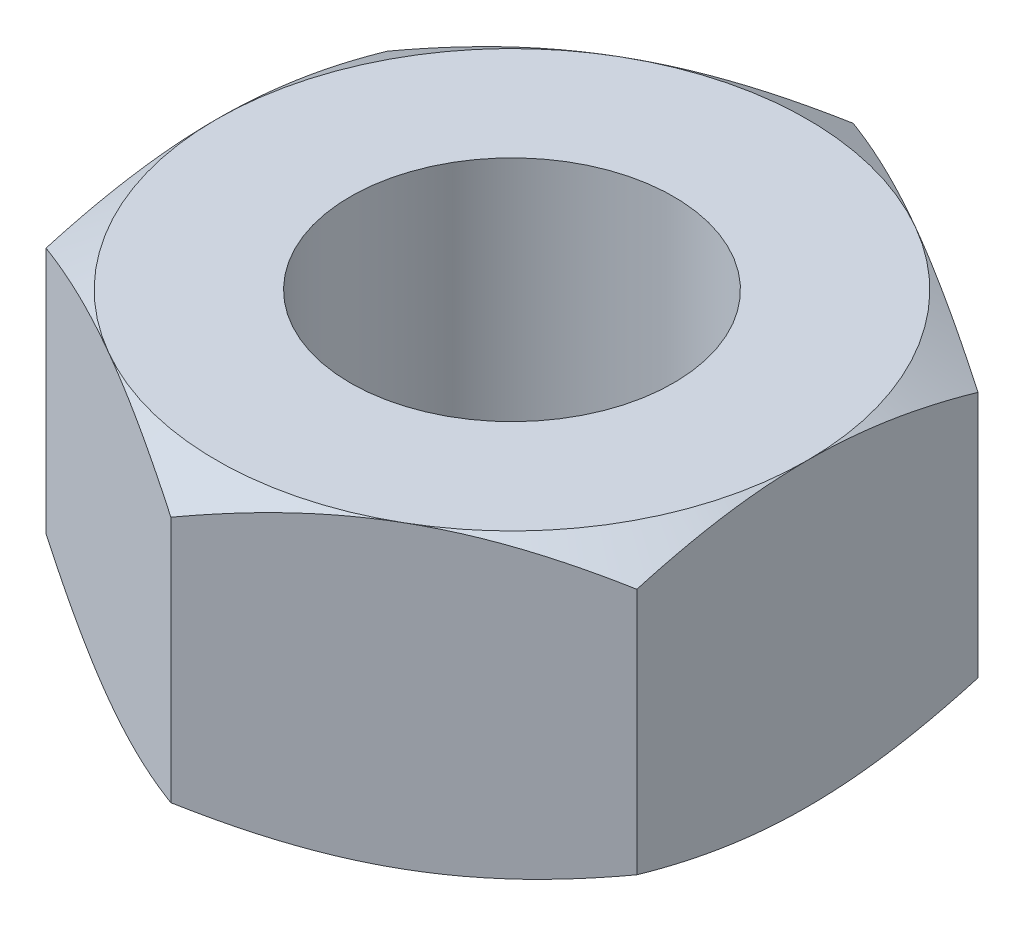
from build123d import *

# Parameters (mm, degrees)
BOSS_EXTRUDE1_DEPTH     = 6.5
SKETCH2_OUTSIDE_W       = 70.482
SKETCH2_OUTSIDE_H       = 74.442
SKETCH2_OUTSIDE_R       = 12.8
CUT_EXTRUDE1_DEPTH      = 10
CUT_EXTRUDE1_DRAFT      = -60
MIRROR1_COPY_1_SKETCH_W = 70.482
MIRROR1_COPY_1_SKETCH_H = 74.442
MIRROR1_COPY_1_SKETCH_R = 12.8
MIRROR1_COPY_1_DEPTH    = 10
MIRROR1_COPY_1_DRAFT    = -60
M16X2_0_TAPPED_HOLE1_D  = 14


with BuildPart() as part:
    # Sketch1 → Boss-Extrude1 (new, symmetric)
    with BuildSketch(Plane(origin=(0, 0, 0), x_dir=(1, 0, 0), z_dir=(0, 1, 0))):
        Polygon((0, 14.780166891), (-12.8, 7.390083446), (-12.8, -7.390083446), (0, -14.780166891), (12.8, -7.390083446), (12.8, 7.390083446), align=None)
    extrude(amount=BOSS_EXTRUDE1_DEPTH, both=True)


with BuildPart() as cut_extrude1_tool:
    # Sketch2 outside → Cut-Extrude1 (with draft: the straight prism first)
    with BuildSketch(Plane(origin=(0, 6.5, 0), x_dir=(1, 0, 0), z_dir=(0, 1, 0))):
        Rectangle(SKETCH2_OUTSIDE_W, SKETCH2_OUTSIDE_H)
        Circle(SKETCH2_OUTSIDE_R, mode=Mode.SUBTRACT)
    extrude(amount=-CUT_EXTRUDE1_DEPTH)
    # Cut-Extrude1: the draft: its side faces are tilted about the plane it starts from
    cut_extrude1_sides = [cut_extrude1_tool.faces().sort_by_distance(p)[0] for p in [
        (0, 1.5, 37.221),
        (35.241, 1.5, 0),
        (0, 1.5, -37.221),
        (-35.241, 1.5, 0),
        (-12.8, 1.5, 0),
    ]]
    draft(cut_extrude1_sides, Plane(origin=(0, 6.5, 0), x_dir=(1, 0, 0), z_dir=(0, 1, 0)), CUT_EXTRUDE1_DRAFT)


with BuildPart() as part_1:
    add(part.part)

    # Cut-Extrude1: cut by cut_extrude1_tool
    add(cut_extrude1_tool.part, mode=Mode.SUBTRACT)


with BuildPart() as mirror1_copy_1_tool:
    # Mirror1 copy 1 sketch → Mirror1 copy 1 (with draft: the straight prism first)
    with BuildSketch(Plane.XZ.offset(6.5)):
        Rectangle(MIRROR1_COPY_1_SKETCH_W, MIRROR1_COPY_1_SKETCH_H)
        Circle(MIRROR1_COPY_1_SKETCH_R, mode=Mode.SUBTRACT)
    extrude(amount=-MIRROR1_COPY_1_DEPTH)
    # Mirror1 copy 1: the draft: its side faces are tilted about the plane it starts from
    mirror1_copy_1_sides = [mirror1_copy_1_tool.faces().sort_by_distance(p)[0] for p in [
        (0, -1.5, 37.221),
        (35.241, -1.5, 0),
        (0, -1.5, -37.221),
        (-35.241, -1.5, 0),
        (-12.8, -1.5, 0),
    ]]
    draft(mirror1_copy_1_sides, Plane.XZ.offset(6.5), MIRROR1_COPY_1_DRAFT)


with BuildPart() as part_2:
    add(part_1.part)

    # Mirror1 copy 1: cut by mirror1_copy_1_tool
    add(mirror1_copy_1_tool.part, mode=Mode.SUBTRACT)

    # M16x2.0 Tapped Hole1 (through all)
    with Locations(Plane(origin=(0, 6.5, 0), x_dir=(-1, 0, 0), z_dir=(0, 1, 0))):
        with Locations((0, 0)):
            Hole(M16X2_0_TAPPED_HOLE1_D / 2)


solid = part_2.part
